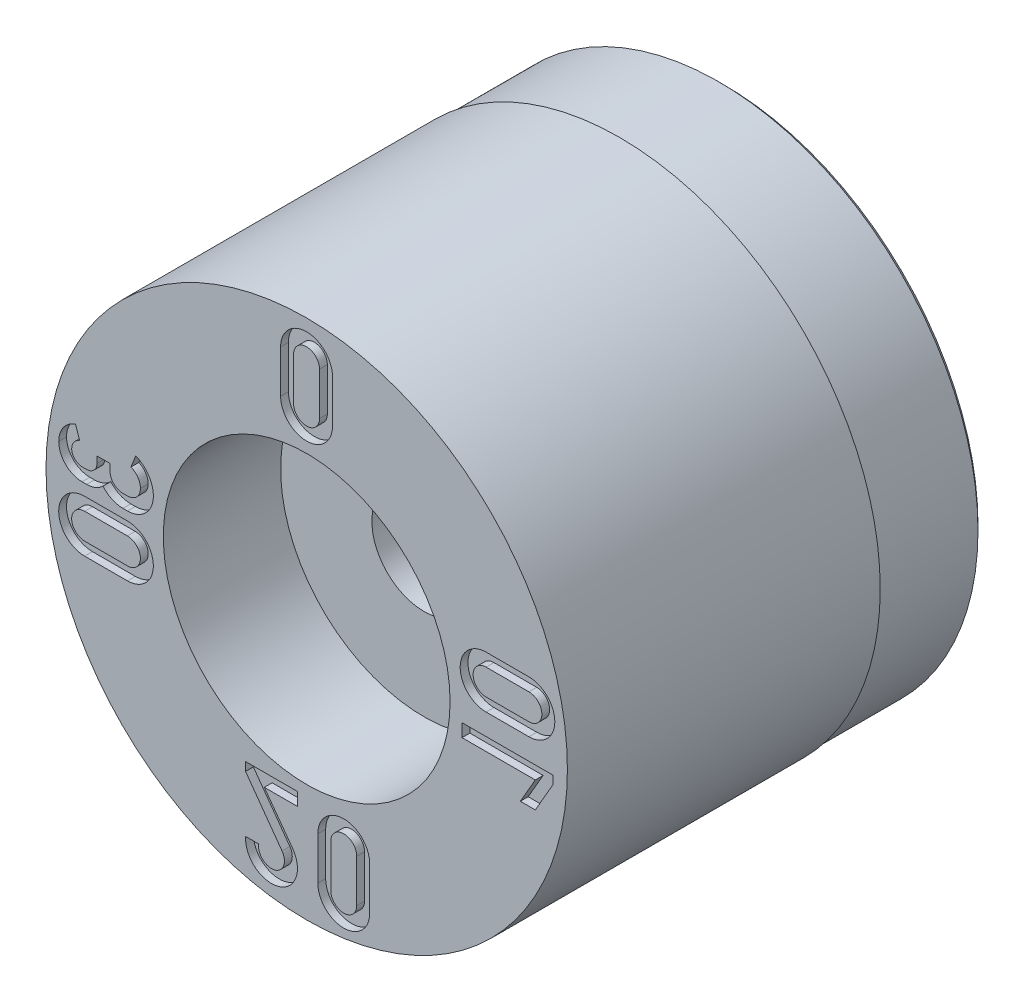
from build123d import *

# Parameters (mm, degrees)
SKETCH4_W          = 4
SKETCH4_H          = 1
CUT_EXTRUDE1_DEPTH = 0.3


with BuildPart() as part:
    # Sketch1 → Revolve1 (revolve)
    with BuildSketch(Plane(origin=(0, 0, 0), x_dir=(0, 0, -1), z_dir=(1, 0, 0)), mode=Mode.PRIVATE) as revolve1_sk:
        Polygon((0, 10), (0, 5.5), (4.5, 5.5), (4.5, 2), (16, 2), (16, 9.75), (15.75, 10), align=None)
    revolve(revolve1_sk.sketch.rotate(Axis((0, 0, 3.797909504), (0, 0, -1)), 90), axis=Axis((0, 0, 3.797909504), (0, 0, -1)))

    # Sketch4 → Cut-Revolve1 (revolve, cut)
    with BuildSketch(Plane(origin=(0, 0, 0), x_dir=(0, 0, -1), z_dir=(1, 0, 0)), mode=Mode.PRIVATE) as cut_revolve1_sk:
        with Locations((14, 10.435)):
            Rectangle(SKETCH4_W, SKETCH4_H)
    revolve(cut_revolve1_sk.sketch.rotate(Axis((0, 0, 0), (0, 0, -1)), 90), axis=Axis((0, 0, 0), (0, 0, -1)), mode=Mode.SUBTRACT)

    # Sketch2 → Cut-Extrude1 (cut)
    # profile 1 of 7: a face of its own
    with BuildSketch(Plane.XY):
        with BuildLine():
            Line((2.416656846, -8.561596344), (2.41679689, -6.920340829))
            ThreePointArc((2.41679689, -6.920340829), (1.42173223, -5.92533953), (0.426777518, -6.92045077))
            Line((0.426777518, -6.92045077), (0.426915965, -8.561764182))
            ThreePointArc((0.426915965, -8.561764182), (1.421870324, -9.556550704), (2.416656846, -8.561596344))
        make_face()
        with BuildLine():
            Line((0.924351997, -6.920408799), (0.924490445, -8.561722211))
            ThreePointArc((0.924490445, -8.561722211), (1.421828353, -9.058976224), (1.919082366, -8.561638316))
            Line((1.919082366, -8.561638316), (1.919222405, -6.920289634))
            ThreePointArc((1.919222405, -6.920289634), (1.421727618, -6.422914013), (0.924351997, -6.920408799))
        make_face(mode=Mode.SUBTRACT)
    # profile 2 of 7: a face of its own
    with BuildSketch(Plane.XY):
        with BuildLine():
            Line((-6.875703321, 0.648941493), (-7.049782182, 0.648956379))
            ThreePointArc((-7.049782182, 0.648956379), (-7.401368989, 0.794623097), (-7.546976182, 1.146234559))
            Line((-7.546976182, 1.146234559), (-7.546954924, 1.394873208))
            Line((-7.546954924, 1.394873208), (-8.044390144, 1.39491575))
            Line((-8.044390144, 1.39491575), (-8.044411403, 1.146337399))
            ThreePointArc((-8.044411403, 1.146337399), (-8.160967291, 0.865014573), (-8.442310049, 0.748506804))
            Line((-8.442310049, 0.748506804), (-8.616364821, 0.748521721))
            ThreePointArc((-8.616364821, 0.748521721), (-8.897588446, 0.865176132), (-9.014214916, 1.146411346))
            ThreePointArc((-9.014214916, 1.146411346), (-8.930362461, 1.407446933), (-8.709894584, 1.570433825))
            Line((-8.709894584, 1.570433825), (-8.869030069, 2.041707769))
            ThreePointArc((-8.869030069, 2.041707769), (-9.334245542, 1.697437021), (-9.511591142, 1.146532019))
            ThreePointArc((-9.511591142, 1.146532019), (-9.249476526, 0.513351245), (-8.616357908, 0.251086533))
            Line((-8.616357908, 0.251086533), (-8.44235259, 0.251071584))
            ThreePointArc((-8.44235259, 0.251071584), (-8.102546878, 0.318066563), (-7.813631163, 0.509074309))
            ThreePointArc((-7.813631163, 0.509074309), (-7.471504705, 0.245302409), (-7.049804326, 0.15152118))
            Line((-7.049804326, 0.15152118), (-6.875661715, 0.151506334))
            ThreePointArc((-6.875661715, 0.151506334), (-6.17232576, 0.442796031), (-5.881013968, 1.146122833))
            ThreePointArc((-5.881013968, 1.146122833), (-6.06627809, 1.747728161), (-6.557838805, 2.140945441))
            Line((-6.557838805, 2.140945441), (-6.740366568, 1.678426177))
            ThreePointArc((-6.740366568, 1.678426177), (-6.477393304, 1.468087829), (-6.378309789, 1.146249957))
            ThreePointArc((-6.378309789, 1.146249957), (-6.5240106, 0.794582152), (-6.875703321, 0.648941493))
        make_face()
    # profile 3 of 7: a face of its own
    with BuildSketch(Plane.XY):
        with BuildLine():
            Line((8.522333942, 2.340564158), (6.881060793, 2.340703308))
            ThreePointArc((6.881060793, 2.340703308), (5.88627482, 1.345768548), (6.881189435, 0.350962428))
            Line((6.881189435, 0.350962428), (8.522502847, 0.351101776))
            ThreePointArc((8.522502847, 0.351101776), (9.517149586, 1.345917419), (8.522333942, 2.340564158))
        make_face()
        with BuildLine():
            Line((6.881147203, 0.848397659), (8.522460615, 0.848537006))
            ThreePointArc((8.522460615, 0.848537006), (9.019714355, 1.345875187), (8.522376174, 1.843128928))
            Line((8.522376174, 1.843128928), (6.881027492, 1.843268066))
            ThreePointArc((6.881027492, 1.843268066), (6.383710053, 1.345773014), (6.881147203, 0.848397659))
        make_face(mode=Mode.SUBTRACT)
    # profile 4 of 7: a face of its own
    with BuildSketch(Plane.XY):
        Polygon((9.439155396, -0.464077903), (9.439183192, -0.791477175), (8.769582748, -1.956161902), (8.195972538, -1.956210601), (8.767687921, -0.961430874), (5.957708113, -0.961669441), (5.957665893, -0.46437348), align=None)
    # profile 5 of 7: a face of its own
    with BuildSketch(Plane.XY):
        with BuildLine():
            Line((-0.356013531, -6.403505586), (-0.356055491, -5.906063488))
            Line((-0.356055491, -5.906063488), (-2.345519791, -5.906231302))
            Line((-2.345519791, -5.906231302), (-2.345492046, -6.235162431))
            Line((-2.345492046, -6.235162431), (-0.946744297, -8.176740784))
            ThreePointArc((-0.946744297, -8.176740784), (-1.23364608, -8.951136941), (-1.842261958, -8.392935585))
            Line((-1.842261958, -8.392935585), (-2.342524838, -8.39298939))
            ThreePointArc((-2.342524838, -8.39298939), (-1.080131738, -9.424796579), (-0.542537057, -7.885558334))
            Line((-0.542537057, -7.885558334), (-1.624389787, -6.403612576))
            Line((-1.624389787, -6.403612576), (-0.356013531, -6.403505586))
        make_face()
    # profile 6 of 7: a face of its own
    with BuildSketch(Plane.XY):
        with BuildLine():
            Line((-1.000782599, 8.544764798), (-1.000644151, 6.903491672))
            ThreePointArc((-1.000644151, 6.903491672), (-0.005709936, 5.908705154), (0.989096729, 6.903619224))
            Line((0.989096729, 6.903619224), (0.98923678, 8.544932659))
            ThreePointArc((0.98923678, 8.544932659), (-0.00585684, 9.539858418), (-1.000782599, 8.544764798))
        make_face()
        with BuildLine():
            Line((0.491661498, 6.903577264), (0.491523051, 8.544890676))
            ThreePointArc((0.491523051, 8.544890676), (-0.005814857, 9.042144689), (-0.50306887, 8.544806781))
            Line((-0.50306887, 8.544806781), (-0.503208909, 6.903458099))
            ThreePointArc((-0.503208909, 6.903458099), (-0.00571413, 6.406140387), (0.491661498, 6.903577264))
        make_face(mode=Mode.SUBTRACT)
    # profile 7 of 7: a face of its own
    with BuildSketch(Plane.XY):
        with BuildLine():
            Line((-8.518180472, -0.180519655), (-6.876907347, -0.180660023))
            ThreePointArc((-6.876907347, -0.180660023), (-5.882091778, -1.175590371), (-6.877027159, -2.170400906))
            Line((-6.877027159, -2.170400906), (-8.518350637, -2.170260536))
            ThreePointArc((-8.518350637, -2.170260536), (-9.513135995, -1.175305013), (-8.518180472, -0.180519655))
        make_face()
        with BuildLine():
            Line((-6.877050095, -1.673104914), (-8.518308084, -1.672686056))
            ThreePointArc((-8.518308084, -1.672686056), (-9.015561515, -1.175347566), (-8.518223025, -0.678094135))
            Line((-8.518223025, -0.678094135), (-6.876874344, -0.677956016))
            ThreePointArc((-6.876874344, -0.677956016), (-6.379387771, -1.175618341), (-6.877050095, -1.673104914))
        make_face(mode=Mode.SUBTRACT)
    extrude(amount=-CUT_EXTRUDE1_DEPTH, mode=Mode.SUBTRACT)


solid = part.part
